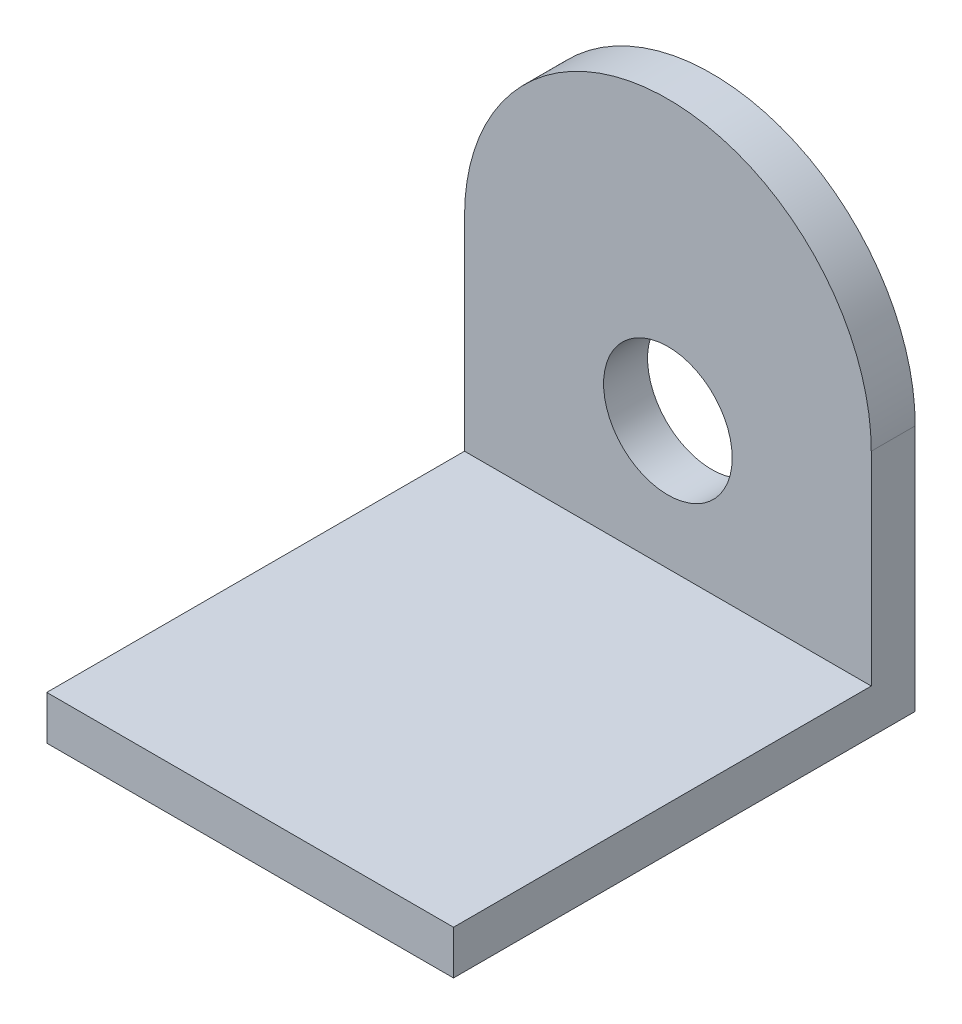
ISO-10303-21;
HEADER;
FILE_DESCRIPTION(('STEP AP214'),'2;1');
FILE_NAME('part.step','',(''),(''),'','','');
FILE_SCHEMA(('AUTOMOTIVE_DESIGN { 1 0 10303 214 1 1 1 1 }'));
ENDSEC;
DATA;
#1=APPLICATION_CONTEXT('core data for automotive mechanical design processes');
#2=APPLICATION_PROTOCOL_DEFINITION('international standard','automotive_design',2000,#1);
#3=PRODUCT_CONTEXT('',#1,'mechanical');
#4=PRODUCT('Part','Part','',(#3));
#5=PRODUCT_RELATED_PRODUCT_CATEGORY('part','',(#4));
#6=PRODUCT_DEFINITION_FORMATION('','',#4);
#7=PRODUCT_DEFINITION_CONTEXT('part definition',#1,'design');
#8=PRODUCT_DEFINITION('design','',#6,#7);
#9=PRODUCT_DEFINITION_SHAPE('','',#8);
#10=(LENGTH_UNIT() NAMED_UNIT(*) SI_UNIT(.MILLI.,.METRE.));
#11=(NAMED_UNIT(*) PLANE_ANGLE_UNIT() SI_UNIT($,.RADIAN.));
#12=(NAMED_UNIT(*) SI_UNIT($,.STERADIAN.) SOLID_ANGLE_UNIT());
#13=UNCERTAINTY_MEASURE_WITH_UNIT(LENGTH_MEASURE(1.E-05),#10,'distance_accuracy_value','');
#14=(GEOMETRIC_REPRESENTATION_CONTEXT(3) GLOBAL_UNCERTAINTY_ASSIGNED_CONTEXT((#13)) GLOBAL_UNIT_ASSIGNED_CONTEXT((#10,
#11,#12)) REPRESENTATION_CONTEXT('',''));
#15=CARTESIAN_POINT('',(0.,0.,0.));
#16=DIRECTION('',(0.,0.,1.));
#17=DIRECTION('',(1.,0.,0.));
#18=AXIS2_PLACEMENT_3D('',#15,#16,#17);
#19=CARTESIAN_POINT('',(-27.6103954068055,0.,4.));
#20=DIRECTION('',(0.,0.,1.));
#21=DIRECTION('',(1.,0.,0.));
#22=AXIS2_PLACEMENT_3D('',#19,#20,#21);
#23=PLANE('',#22);
#24=CARTESIAN_POINT('',(-27.6103954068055,-6.85,4.));
#25=DIRECTION('',(0.,0.,1.));
#26=DIRECTION('',(1.,0.,0.));
#27=AXIS2_PLACEMENT_3D('',#24,#25,#26);
#28=CIRCLE('',#27,5.85);
#29=CARTESIAN_POINT('',(-21.7603954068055,-6.85,4.));
#30=VERTEX_POINT('',#29);
#31=EDGE_CURVE('E98',#30,#30,#28,.T.);
#32=ORIENTED_EDGE('',*,*,#31,.F.);
#33=EDGE_LOOP('',(#32));
#34=FACE_BOUND('',#33,.T.);
#35=DIRECTION('',(0.,-1.,0.));
#36=VECTOR('',#35,1.);
#37=CARTESIAN_POINT('',(-46.1103954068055,0.,4.));
#38=LINE('',#37,#36);
#39=CARTESIAN_POINT('',(-46.1103954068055,0.,4.));
#40=VERTEX_POINT('',#39);
#41=CARTESIAN_POINT('',(-46.1103954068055,-18.5,4.00000000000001));
#42=VERTEX_POINT('',#41);
#43=EDGE_CURVE('E137',#40,#42,#38,.T.);
#44=ORIENTED_EDGE('',*,*,#43,.T.);
#45=DIRECTION('',(1.,0.,0.));
#46=VECTOR('',#45,1.);
#47=CARTESIAN_POINT('',(-27.6103954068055,-18.5,4.));
#48=LINE('',#47,#46);
#49=CARTESIAN_POINT('',(-9.11039540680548,-18.5,4.));
#50=VERTEX_POINT('',#49);
#51=EDGE_CURVE('E132',#42,#50,#48,.T.);
#52=ORIENTED_EDGE('',*,*,#51,.T.);
#53=DIRECTION('',(0.,1.,0.));
#54=VECTOR('',#53,1.);
#55=CARTESIAN_POINT('',(-9.11039540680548,0.,4.));
#56=LINE('',#55,#54);
#57=CARTESIAN_POINT('',(-9.11039540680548,0.,4.));
#58=VERTEX_POINT('',#57);
#59=EDGE_CURVE('E56',#50,#58,#56,.T.);
#60=ORIENTED_EDGE('',*,*,#59,.T.);
#61=CARTESIAN_POINT('',(-27.6103954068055,0.,4.));
#62=DIRECTION('',(0.,0.,1.));
#63=DIRECTION('',(1.,0.,0.));
#64=AXIS2_PLACEMENT_3D('',#61,#62,#63);
#65=CIRCLE('',#64,18.5);
#66=EDGE_CURVE('E87',#58,#40,#65,.T.);
#67=ORIENTED_EDGE('',*,*,#66,.T.);
#68=EDGE_LOOP('',(#44,#52,#60,#67));
#69=FACE_BOUND('',#68,.T.);
#70=ADVANCED_FACE('F33',(#34,#69),#23,.T.);
#71=CARTESIAN_POINT('',(-27.6103954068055,0.,0.));
#72=DIRECTION('',(0.,0.,1.));
#73=DIRECTION('',(1.,0.,0.));
#74=AXIS2_PLACEMENT_3D('',#71,#72,#73);
#75=PLANE('',#74);
#76=DIRECTION('',(1.,0.,0.));
#77=VECTOR('',#76,1.);
#78=CARTESIAN_POINT('',(-46.1103954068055,-22.5,0.));
#79=LINE('',#78,#77);
#80=CARTESIAN_POINT('',(-46.1103954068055,-22.5,0.));
#81=VERTEX_POINT('',#80);
#82=CARTESIAN_POINT('',(-9.11039540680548,-22.5,0.));
#83=VERTEX_POINT('',#82);
#84=EDGE_CURVE('E88',#81,#83,#79,.T.);
#85=ORIENTED_EDGE('',*,*,#84,.F.);
#86=DIRECTION('',(0.,-1.,0.));
#87=VECTOR('',#86,1.);
#88=CARTESIAN_POINT('',(-46.1103954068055,0.,0.));
#89=LINE('',#88,#87);
#90=CARTESIAN_POINT('',(-46.1103954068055,0.,0.));
#91=VERTEX_POINT('',#90);
#92=EDGE_CURVE('E97',#91,#81,#89,.T.);
#93=ORIENTED_EDGE('',*,*,#92,.F.);
#94=CARTESIAN_POINT('',(-27.6103954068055,0.,0.));
#95=DIRECTION('',(0.,0.,1.));
#96=DIRECTION('',(1.,0.,0.));
#97=AXIS2_PLACEMENT_3D('',#94,#95,#96);
#98=CIRCLE('',#97,18.5);
#99=CARTESIAN_POINT('',(-9.11039540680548,0.,0.));
#100=VERTEX_POINT('',#99);
#101=EDGE_CURVE('E93',#100,#91,#98,.T.);
#102=ORIENTED_EDGE('',*,*,#101,.F.);
#103=DIRECTION('',(0.,1.,0.));
#104=VECTOR('',#103,1.);
#105=CARTESIAN_POINT('',(-9.11039540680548,0.,0.));
#106=LINE('',#105,#104);
#107=EDGE_CURVE('E76',#83,#100,#106,.T.);
#108=ORIENTED_EDGE('',*,*,#107,.F.);
#109=EDGE_LOOP('',(#85,#93,#102,#108));
#110=FACE_BOUND('',#109,.T.);
#111=CARTESIAN_POINT('',(-27.6103954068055,-6.85,0.));
#112=DIRECTION('',(0.,0.,1.));
#113=DIRECTION('',(1.,0.,0.));
#114=AXIS2_PLACEMENT_3D('',#111,#112,#113);
#115=CIRCLE('',#114,5.85);
#116=CARTESIAN_POINT('',(-21.7603954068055,-6.85,0.));
#117=VERTEX_POINT('',#116);
#118=EDGE_CURVE('E102',#117,#117,#115,.T.);
#119=ORIENTED_EDGE('',*,*,#118,.T.);
#120=EDGE_LOOP('',(#119));
#121=FACE_BOUND('',#120,.T.);
#122=ADVANCED_FACE('F95',(#110,#121),#75,.F.);
#123=CARTESIAN_POINT('',(-27.6103954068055,0.,4.));
#124=DIRECTION('',(0.,0.,-1.));
#125=DIRECTION('',(-1.,0.,0.));
#126=AXIS2_PLACEMENT_3D('',#123,#124,#125);
#127=CYLINDRICAL_SURFACE('',#126,18.5);
#128=ORIENTED_EDGE('',*,*,#101,.T.);
#129=DIRECTION('',(0.,0.,-1.));
#130=VECTOR('',#129,1.);
#131=CARTESIAN_POINT('',(-46.1103954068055,0.,4.));
#132=LINE('',#131,#130);
#133=EDGE_CURVE('E11',#40,#91,#132,.T.);
#134=ORIENTED_EDGE('',*,*,#133,.F.);
#135=ORIENTED_EDGE('',*,*,#66,.F.);
#136=DIRECTION('',(0.,0.,-1.));
#137=VECTOR('',#136,1.);
#138=CARTESIAN_POINT('',(-9.11039540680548,0.,4.));
#139=LINE('',#138,#137);
#140=EDGE_CURVE('E79',#58,#100,#139,.T.);
#141=ORIENTED_EDGE('',*,*,#140,.T.);
#142=EDGE_LOOP('',(#128,#134,#135,#141));
#143=FACE_BOUND('',#142,.T.);
#144=ADVANCED_FACE('F35',(#143),#127,.T.);
#145=CARTESIAN_POINT('',(-46.1103954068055,0.,4.));
#146=DIRECTION('',(1.,0.,0.));
#147=DIRECTION('',(0.,0.,-1.));
#148=AXIS2_PLACEMENT_3D('',#145,#146,#147);
#149=PLANE('',#148);
#150=DIRECTION('',(0.,0.,-1.));
#151=VECTOR('',#150,1.);
#152=CARTESIAN_POINT('',(-46.1103954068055,-22.5,4.));
#153=LINE('',#152,#151);
#154=CARTESIAN_POINT('',(-46.1103954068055,-22.5,42.));
#155=VERTEX_POINT('',#154);
#156=EDGE_CURVE('E41',#155,#81,#153,.T.);
#157=ORIENTED_EDGE('',*,*,#156,.F.);
#158=DIRECTION('',(0.,-1.,0.));
#159=VECTOR('',#158,1.);
#160=CARTESIAN_POINT('',(-46.1103954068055,-22.5,42.));
#161=LINE('',#160,#159);
#162=CARTESIAN_POINT('',(-46.1103954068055,-18.5,42.));
#163=VERTEX_POINT('',#162);
#164=EDGE_CURVE('E122',#163,#155,#161,.T.);
#165=ORIENTED_EDGE('',*,*,#164,.F.);
#166=DIRECTION('',(0.,0.,-1.));
#167=VECTOR('',#166,1.);
#168=CARTESIAN_POINT('',(-46.1103954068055,-18.5,42.));
#169=LINE('',#168,#167);
#170=EDGE_CURVE('E134',#163,#42,#169,.T.);
#171=ORIENTED_EDGE('',*,*,#170,.T.);
#172=ORIENTED_EDGE('',*,*,#43,.F.);
#173=ORIENTED_EDGE('',*,*,#133,.T.);
#174=ORIENTED_EDGE('',*,*,#92,.T.);
#175=EDGE_LOOP('',(#157,#165,#171,#172,#173,#174));
#176=FACE_BOUND('',#175,.T.);
#177=ADVANCED_FACE('F119',(#176),#149,.F.);
#178=CARTESIAN_POINT('',(-46.1103954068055,-22.5,4.));
#179=DIRECTION('',(0.,1.,0.));
#180=DIRECTION('',(-1.,0.,0.));
#181=AXIS2_PLACEMENT_3D('',#178,#179,#180);
#182=PLANE('',#181);
#183=ORIENTED_EDGE('',*,*,#84,.T.);
#184=DIRECTION('',(0.,0.,-1.));
#185=VECTOR('',#184,1.);
#186=CARTESIAN_POINT('',(-9.11039540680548,-22.5,4.));
#187=LINE('',#186,#185);
#188=CARTESIAN_POINT('',(-9.11039540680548,-22.5,42.));
#189=VERTEX_POINT('',#188);
#190=EDGE_CURVE('E83',#189,#83,#187,.T.);
#191=ORIENTED_EDGE('',*,*,#190,.F.);
#192=DIRECTION('',(1.,0.,0.));
#193=VECTOR('',#192,1.);
#194=CARTESIAN_POINT('',(-46.1103954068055,-22.5,42.));
#195=LINE('',#194,#193);
#196=EDGE_CURVE('E115',#155,#189,#195,.T.);
#197=ORIENTED_EDGE('',*,*,#196,.F.);
#198=ORIENTED_EDGE('',*,*,#156,.T.);
#199=EDGE_LOOP('',(#183,#191,#197,#198));
#200=FACE_BOUND('',#199,.T.);
#201=ADVANCED_FACE('F112',(#200),#182,.F.);
#202=CARTESIAN_POINT('',(-9.11039540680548,0.,4.));
#203=DIRECTION('',(-1.,0.,0.));
#204=DIRECTION('',(0.,-1.,0.));
#205=AXIS2_PLACEMENT_3D('',#202,#203,#204);
#206=PLANE('',#205);
#207=ORIENTED_EDGE('',*,*,#107,.T.);
#208=ORIENTED_EDGE('',*,*,#140,.F.);
#209=ORIENTED_EDGE('',*,*,#59,.F.);
#210=DIRECTION('',(0.,0.,-1.));
#211=VECTOR('',#210,1.);
#212=CARTESIAN_POINT('',(-9.11039540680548,-18.5,42.));
#213=LINE('',#212,#211);
#214=CARTESIAN_POINT('',(-9.11039540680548,-18.5,42.));
#215=VERTEX_POINT('',#214);
#216=EDGE_CURVE('E48',#215,#50,#213,.T.);
#217=ORIENTED_EDGE('',*,*,#216,.F.);
#218=DIRECTION('',(0.,1.,0.));
#219=VECTOR('',#218,1.);
#220=CARTESIAN_POINT('',(-9.11039540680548,-22.5,42.));
#221=LINE('',#220,#219);
#222=EDGE_CURVE('E146',#189,#215,#221,.T.);
#223=ORIENTED_EDGE('',*,*,#222,.F.);
#224=ORIENTED_EDGE('',*,*,#190,.T.);
#225=EDGE_LOOP('',(#207,#208,#209,#217,#223,#224));
#226=FACE_BOUND('',#225,.T.);
#227=ADVANCED_FACE('F78',(#226),#206,.F.);
#228=CARTESIAN_POINT('',(-27.6103954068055,-6.85,4.));
#229=DIRECTION('',(0.,0.,-1.));
#230=DIRECTION('',(-1.,0.,0.));
#231=AXIS2_PLACEMENT_3D('',#228,#229,#230);
#232=CYLINDRICAL_SURFACE('',#231,5.85);
#233=ORIENTED_EDGE('',*,*,#31,.T.);
#234=EDGE_LOOP('',(#233));
#235=FACE_BOUND('',#234,.T.);
#236=ORIENTED_EDGE('',*,*,#118,.F.);
#237=EDGE_LOOP('',(#236));
#238=FACE_BOUND('',#237,.T.);
#239=ADVANCED_FACE('F156',(#235,#238),#232,.F.);
#240=CARTESIAN_POINT('',(-46.1103954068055,-18.5,42.));
#241=DIRECTION('',(0.,-1.,0.));
#242=DIRECTION('',(0.,0.,-1.));
#243=AXIS2_PLACEMENT_3D('',#240,#241,#242);
#244=PLANE('',#243);
#245=ORIENTED_EDGE('',*,*,#51,.F.);
#246=ORIENTED_EDGE('',*,*,#170,.F.);
#247=DIRECTION('',(-1.,0.,0.));
#248=VECTOR('',#247,1.);
#249=CARTESIAN_POINT('',(-46.1103954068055,-18.5,42.));
#250=LINE('',#249,#248);
#251=EDGE_CURVE('E138',#215,#163,#250,.T.);
#252=ORIENTED_EDGE('',*,*,#251,.F.);
#253=ORIENTED_EDGE('',*,*,#216,.T.);
#254=EDGE_LOOP('',(#245,#246,#252,#253));
#255=FACE_BOUND('',#254,.T.);
#256=ADVANCED_FACE('F133',(#255),#244,.F.);
#257=CARTESIAN_POINT('',(0.,0.,42.));
#258=DIRECTION('',(0.,0.,-1.));
#259=DIRECTION('',(-1.,0.,0.));
#260=AXIS2_PLACEMENT_3D('',#257,#258,#259);
#261=PLANE('',#260);
#262=ORIENTED_EDGE('',*,*,#164,.T.);
#263=ORIENTED_EDGE('',*,*,#196,.T.);
#264=ORIENTED_EDGE('',*,*,#222,.T.);
#265=ORIENTED_EDGE('',*,*,#251,.T.);
#266=EDGE_LOOP('',(#262,#263,#264,#265));
#267=FACE_BOUND('',#266,.T.);
#268=ADVANCED_FACE('F150',(#267),#261,.F.);
#269=CLOSED_SHELL('',(#70,#122,#144,#177,#201,#227,#239,#256,#268));
#270=MANIFOLD_SOLID_BREP('B2',#269);
#271=ADVANCED_BREP_SHAPE_REPRESENTATION('',(#18,#270),#14);
#272=SHAPE_DEFINITION_REPRESENTATION(#9,#271);
ENDSEC;
END-ISO-10303-21;
